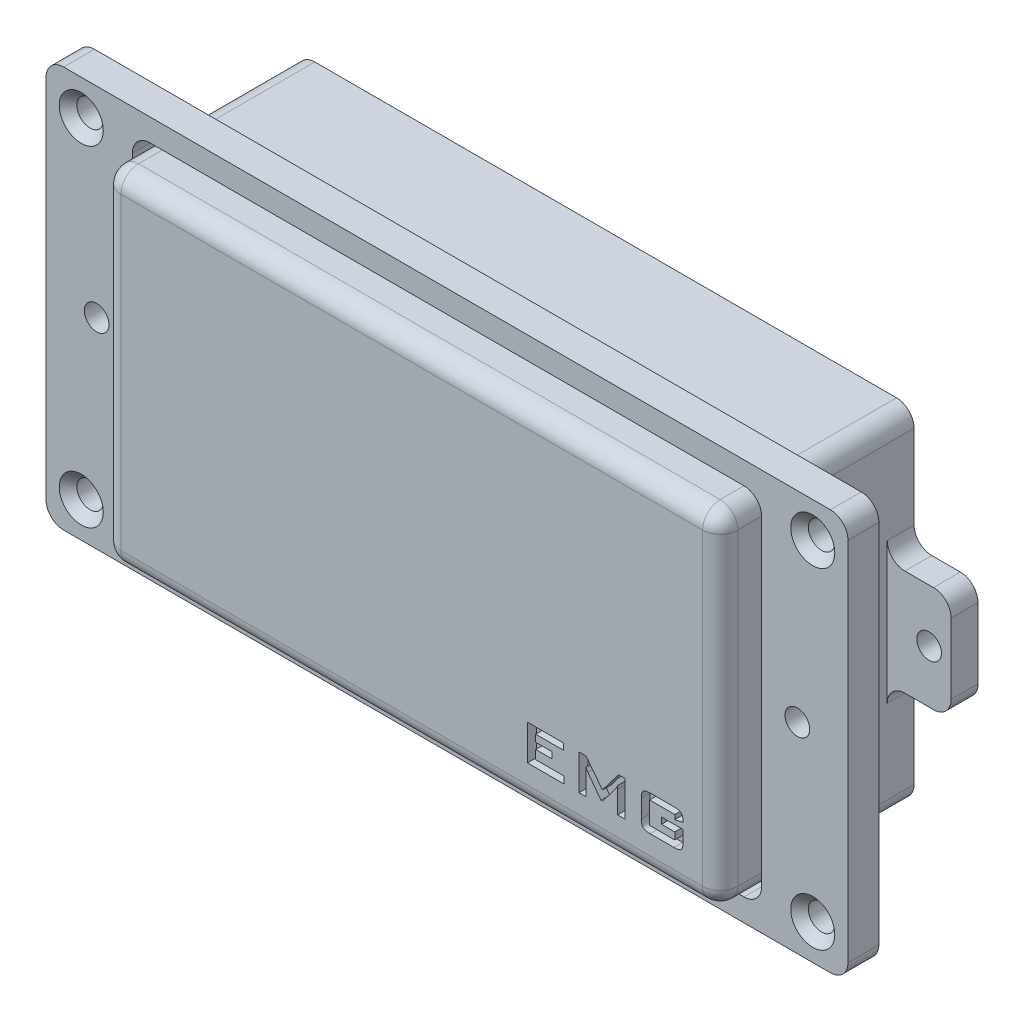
from build123d import *

# Parameters (mm, degrees)
SKETCH_1_W          = 70
SKETCH_1_H          = 39
EXTRUDE_1_DEPTH     = 22
SKETCH_2_W          = 84.5
SKETCH_2_H          = 12
SKETCH_2_R          = 1.4
EXTRUDE_2_DEPTH     = 3.05
SKETCH_3_W          = 91
SKETCH_3_H          = 45.5
SKETCH_3_W_2        = 71.4
SKETCH_3_H_2        = 40.4
EXTRUDE_3_DEPTH     = 7.5
SKETCH_4_W          = 91
SKETCH_4_H          = 45.5
SKETCH_4_W_2        = 71.4
SKETCH_4_H_2        = 40.4
CUT_EXTRUDE_1_DEPTH = 4
SKETCH_5_R          = 1.4
CUT_EXTRUDE_2_DEPTH = 64
SKETCH_6_R          = 1.5
CUT_EXTRUDE_3_DEPTH = 10
FILLET_1_R          = 2
FILLET_2_R          = 2
FILLET_3_R          = 2
CHAMFER_1_SIZE      = 1
CUT_EXTRUDE_4_DEPTH = 1
FILLET_4_R          = 2
SKETCH_8_W          = 66
SKETCH_8_H          = 35
CUT_EXTRUDE_5_DEPTH = 1
SKETCH_9_W          = 88
SKETCH_9_H          = 42.5
SKETCH_9_W_2        = 70.228427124
SKETCH_9_H_2        = 39.228427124
CUT_EXTRUDE_6_DEPTH = 1
SKETCH_11_R         = 2
SKETCH_11_R_2       = 1.5
EXTRUDE_4_DEPTH     = 1


with BuildPart() as part:
    # Sketch 1 → Extrude 1 (new body)
    with BuildSketch(Plane.XY):
        Rectangle(SKETCH_1_W, SKETCH_1_H)
    extrude(amount=-EXTRUDE_1_DEPTH)

    # Sketch 2 → Extrude 2 (add)
    with BuildSketch(Plane(origin=(0, 0, -22), x_dir=(-1, 0, 0), z_dir=(0, 0, -1))):
        Rectangle(SKETCH_2_W, SKETCH_2_H)
        with Locations((-39.75, 0)):
            Circle(SKETCH_2_R, mode=Mode.SUBTRACT)
        with Locations((39.75, 0)):
            Circle(SKETCH_2_R, mode=Mode.SUBTRACT)
    extrude(amount=-EXTRUDE_2_DEPTH)

    # Fillet 1
    fillet_1_edges = [part.edges().sort_by_distance(p)[0] for p in [
        (-35, 19.5, -11),
        (35, 19.5, -11),
        (35, -19.5, -11),
        (-35, -19.5, -11),
        (0, 19.5, 0),
        (-35, 0, 0),
        (0, -19.5, 0),
        (35, 0, 0),
    ]]
    fillet(fillet_1_edges, radius=FILLET_1_R)

    # Sketch 7 → Cut-Extrude 4 (cut)
    with BuildSketch(Plane.XY):
        with BuildLine():
            Line((29.843212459, -12.026020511), (26.986069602, -12.026020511))
            Line((26.986069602, -12.026020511), (26.986069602, -14.526020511))
            Line((26.986069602, -14.526020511), (29.843212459, -14.526020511))
            Line((29.843212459, -14.526020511), (29.843212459, -13.740306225))
            Line((29.843212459, -13.740306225), (28.343212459, -13.740306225))
            Line((28.343212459, -13.740306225), (28.343212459, -13.026020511))
            Line((28.343212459, -13.026020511), (30.771783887, -13.026020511))
            Line((30.771783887, -13.026020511), (30.771783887, -14.355261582))
            add(Edge.make_bspline(
                [(30.771783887, -14.355261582), (30.771227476, -14.399558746), (30.770155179, -14.484926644), (30.759662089, -14.607080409), (30.745100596, -14.718897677), (30.721395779, -14.818763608), (30.693021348, -14.908693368), (30.655960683, -14.986722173), (30.613764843, -15.054941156), (30.563438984, -15.112536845), (30.503071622, -15.160597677), (30.432084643, -15.201948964), (30.348647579, -15.236337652), (30.253371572, -15.263414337), (30.146428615, -15.286093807), (30.027350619, -15.301005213), (29.896172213, -15.309739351), (29.804908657, -15.311050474), (29.757274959, -15.311734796)],
                knots=[0, 0, 0, 0, 1.287740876, 2.481687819, 3.563317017, 4.56308199, 5.462791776, 6.299975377, 7.068275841, 7.7887847, 8.511887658, 9.302262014, 10.170193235, 11.128662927, 12.178892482, 13.346275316, 14.614926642, 16, 16, 16, 16], degree=3))
            Line((29.757274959, -15.311734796), (27.045221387, -15.311734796))
            add(Edge.make_bspline(
                [(27.045221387, -15.311734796), (26.998704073, -15.311048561), (26.909670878, -15.309735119), (26.781824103, -15.301050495), (26.665748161, -15.28596134), (26.561690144, -15.263637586), (26.469094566, -15.236176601), (26.387970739, -15.201699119), (26.318336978, -15.160614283), (26.259077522, -15.112494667), (26.209996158, -15.054830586), (26.168626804, -14.986921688), (26.134398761, -14.908302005), (26.106534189, -14.81877894), (26.08496672, -14.718619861), (26.06759993, -14.607280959), (26.059700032, -14.484840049), (26.058250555, -14.399538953), (26.057498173, -14.355261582)],
                knots=[0, 0, 0, 0, 1.370936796, 2.623945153, 3.774521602, 4.817517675, 5.757449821, 6.616944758, 7.408582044, 8.132975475, 8.856040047, 9.628928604, 10.468327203, 11.376846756, 12.387708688, 13.485566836, 14.694829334, 16, 16, 16, 16], degree=3))
            Line((26.057498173, -14.355261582), (26.057498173, -12.284949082))
            add(Edge.make_bspline(
                [(26.057498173, -12.284949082), (26.058222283, -12.239925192), (26.059606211, -12.153874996), (26.067792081, -12.029984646), (26.084801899, -11.917473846), (26.10677317, -11.815564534), (26.134168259, -11.72441908), (26.168653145, -11.644407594), (26.20998129, -11.575390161), (26.259029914, -11.516606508), (26.31825442, -11.467325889), (26.387891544, -11.425099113), (26.469037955, -11.389561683), (26.561491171, -11.360666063), (26.665770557, -11.338641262), (26.781869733, -11.323861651), (26.909614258, -11.313321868), (26.998694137, -11.312279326), (27.045221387, -11.311734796)],
                knots=[0, 0, 0, 0, 1.316875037, 2.516827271, 3.627751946, 4.641454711, 5.56374866, 6.406644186, 7.182863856, 7.908645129, 8.634426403, 9.425599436, 10.282837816, 11.218764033, 12.253729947, 13.395447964, 14.63961822, 16, 16, 16, 16], degree=3))
            Line((27.045221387, -11.311734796), (29.757274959, -11.311734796))
            add(Edge.make_bspline(
                [(29.757274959, -11.311734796), (29.804534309, -11.312431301), (29.895050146, -11.313765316), (30.024778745, -11.322307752), (30.142637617, -11.337730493), (30.249143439, -11.359639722), (30.343967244, -11.388566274), (30.427693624, -11.422497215), (30.498690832, -11.464351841), (30.560173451, -11.511898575), (30.610665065, -11.569375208), (30.655415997, -11.634813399), (30.690111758, -11.711985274), (30.720534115, -11.798095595), (30.743701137, -11.894988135), (30.759891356, -12.001758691), (30.770113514, -12.118829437), (30.771210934, -12.200105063), (30.771783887, -12.242538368)],
                knots=[0, 0, 0, 0, 1.397762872, 2.67713531, 3.842667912, 4.91085992, 5.888884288, 6.771660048, 7.57555246, 8.319614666, 9.059761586, 9.828787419, 10.655693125, 11.553495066, 12.527550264, 13.596648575, 14.745230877, 16, 16, 16, 16], degree=3))
            Line((30.771783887, -12.242538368), (30.771783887, -12.344100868))
            Line((30.771783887, -12.344100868), (29.843212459, -12.526020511))
            Line((29.843212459, -12.526020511), (29.843212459, -12.026020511))
        make_face()
        with BuildLine():
            Line((18.986069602, -15.311734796), (18.986069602, -11.311734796))
            Line((18.986069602, -11.311734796), (19.771783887, -11.311734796))
            Line((19.771783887, -11.311734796), (21.635623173, -13.716868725))
            Line((21.635623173, -13.716868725), (23.46151603, -11.311734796))
            Line((23.46151603, -11.311734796), (24.200355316, -11.311734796))
            Line((24.200355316, -11.311734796), (24.200355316, -15.311734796))
            Line((24.200355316, -15.311734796), (23.343212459, -15.311734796))
            Line((23.343212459, -15.311734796), (23.343212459, -12.831824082))
            add(Edge.make_bspline(
                [(23.343212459, -12.831824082), (23.343737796, -12.804657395), (23.344904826, -12.744306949), (23.352146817, -12.645307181), (23.363625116, -12.530815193), (23.37219349, -12.449380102), (23.376694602, -12.406600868)],
                knots=[0, 0, 0, 0, 0.764017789, 1.697255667, 2.790329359, 4, 4, 4, 4], degree=3))
            add(Edge.make_bspline(
                [(23.376694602, -12.406600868), (23.353664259, -12.454059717), (23.311808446, -12.540312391), (23.24923835, -12.655053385), (23.196782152, -12.748341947), (23.160865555, -12.801144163), (23.144551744, -12.825127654)],
                knots=[0, 0, 0, 0, 1.321116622, 2.401024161, 3.27372327, 4, 4, 4, 4], degree=3))
            Line((23.144551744, -12.825127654), (21.657944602, -14.811734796))
            Line((21.657944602, -14.811734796), (21.474908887, -14.811734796))
            Line((21.474908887, -14.811734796), (19.98495353, -12.817315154))
            add(Edge.make_bspline(
                [(19.98495353, -12.817315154), (19.959382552, -12.781049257), (19.910496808, -12.711717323), (19.844354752, -12.608743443), (19.792007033, -12.508791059), (19.762539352, -12.442833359), (19.748346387, -12.411065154)],
                knots=[0, 0, 0, 0, 1.130076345, 2.160442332, 3.113985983, 4, 4, 4, 4], degree=3))
            add(Edge.make_bspline(
                [(19.748346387, -12.411065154), (19.752390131, -12.450474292), (19.760087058, -12.525486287), (19.766105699, -12.633871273), (19.771438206, -12.734672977), (19.771670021, -12.799822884), (19.771783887, -12.831824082)],
                knots=[0, 0, 0, 0, 1.127408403, 2.145927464, 3.089291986, 4, 4, 4, 4], degree=3))
            Line((19.771783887, -12.831824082), (19.771783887, -15.311734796))
            Line((19.771783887, -15.311734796), (18.986069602, -15.311734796))
        make_face()
        Polygon((13.128926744, -15.311734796), (13.128926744, -11.311734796), (17.200355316, -11.311734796), (17.200355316, -12.026020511), (14.057498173, -12.026020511), (14.057498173, -12.811734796), (15.91464103, -12.811734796), (15.91464103, -13.526020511), (14.057498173, -13.526020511), (14.057498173, -14.526020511), (17.271783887, -14.526020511), (17.271783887, -15.311734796), align=None)
    extrude(amount=-CUT_EXTRUDE_4_DEPTH, mode=Mode.SUBTRACT)

    # Fillet 4
    fillet_4_edges = [part.edges().sort_by_distance(p)[0] for p in [
        (-42.25, 6, -20.475),
        (-35, 6, -20.475),
        (-42.25, -6, -20.475),
        (-35, -6, -20.475),
        (35, -6, -20.475),
        (42.25, -6, -20.475),
        (35, 6, -20.475),
        (42.25, 6, -20.475),
    ]]
    fillet(fillet_4_edges, radius=FILLET_4_R)

    # Sketch 8 → Cut-Extrude 5 (cut)
    with BuildSketch(Plane(origin=(0, 0, -22), x_dir=(-1, 0, 0), z_dir=(0, 0, -1))):
        Rectangle(SKETCH_8_W, SKETCH_8_H)
    extrude(amount=-CUT_EXTRUDE_5_DEPTH, mode=Mode.SUBTRACT)


with BuildPart() as body_2:
    # Sketch 3 → Extrude 3 (new body)
    with BuildSketch(Plane.XY):
        Rectangle(SKETCH_3_W, SKETCH_3_H)
        Rectangle(SKETCH_3_W_2, SKETCH_3_H_2, mode=Mode.SUBTRACT)
    extrude(amount=-EXTRUDE_3_DEPTH)

    # Sketch 4 → Cut-Extrude 1 (cut)
    with BuildSketch(Plane.XY):
        Rectangle(SKETCH_4_W, SKETCH_4_H)
        Rectangle(SKETCH_4_W_2, SKETCH_4_H_2, mode=Mode.SUBTRACT)
    extrude(amount=-CUT_EXTRUDE_1_DEPTH, mode=Mode.SUBTRACT)

    # Sketch 5 → Cut-Extrude 2 (cut)
    with BuildSketch(Plane(origin=(0, 0, -22), x_dir=(-1, 0, 0), z_dir=(0, 0, -1))):
        with Locations(Location((-39.75, 0, 0), (0, 0, 180))):
            Circle(SKETCH_5_R)
        with Locations(Location((39.75, 0, 0), (0, 0, 180))):
            Circle(SKETCH_5_R)
    extrude(amount=-CUT_EXTRUDE_2_DEPTH, mode=Mode.SUBTRACT)

    # Sketch 6 → Cut-Extrude 3 (cut)
    with BuildSketch(Plane.XY.offset(-4)):
        with Locations((41.5, -18.75)):
            Circle(SKETCH_6_R)
        with Locations((-41.5, -18.75)):
            Circle(SKETCH_6_R)
        with Locations((-41.5, 18.75)):
            Circle(SKETCH_6_R)
        with Locations((41.5, 18.75)):
            Circle(SKETCH_6_R)
    extrude(amount=-CUT_EXTRUDE_3_DEPTH, mode=Mode.SUBTRACT)

    # Fillet 2
    fillet_2_edges = [body_2.edges().sort_by_distance(p)[0] for p in [
        (45.5, -22.75, -5.75),
        (-45.5, -22.75, -5.75),
        (-45.5, 22.75, -5.75),
        (45.5, 22.75, -5.75),
    ]]
    fillet(fillet_2_edges, radius=FILLET_2_R)

    # Fillet 3
    fillet_3_edges = [body_2.edges().sort_by_distance(p)[0] for p in [
        (-35.7, 20.2, -5.75),
        (-35.7, -20.2, -5.75),
        (35.7, -20.2, -5.75),
        (35.7, 20.2, -5.75),
    ]]
    fillet(fillet_3_edges, radius=FILLET_3_R)

    # Chamfer 1
    chamfer_1_edges = [body_2.edges().sort_by_distance(p)[0] for p in [
        (40, 18.75, -4),
        (40, -18.75, -4),
        (-43, -18.75, -4),
        (-43, 18.75, -4),
    ]]
    chamfer(chamfer_1_edges, length=CHAMFER_1_SIZE)

    # Sketch 9 → Cut-Extrude 6 (cut)
    with BuildSketch(Plane(origin=(0, 0, -7.5), x_dir=(-1, 0, 0), z_dir=(0, 0, -1))):
        Rectangle(SKETCH_9_W, SKETCH_9_H)
        Rectangle(SKETCH_9_W_2, SKETCH_9_H_2, mode=Mode.SUBTRACT)
    extrude(amount=-CUT_EXTRUDE_6_DEPTH, mode=Mode.SUBTRACT)

    # Sketch 11 → Extrude 4 (add)
    # profile 1 of 4: a face of its own
    with BuildSketch(Plane(origin=(0, 0, -6.5), x_dir=(-1, 0, 0), z_dir=(0, 0, -1))):
        with Locations(Location((-41.5, 18.75, 0), (0, 0, 180))):
            Circle(SKETCH_11_R)
        with Locations(Location((-41.5, 18.75, 0), (0, 0, 180))):
            Circle(SKETCH_11_R_2, mode=Mode.SUBTRACT)
    # profile 2 of 4: a face of its own
    with BuildSketch(Plane(origin=(0, 0, -6.5), x_dir=(-1, 0, 0), z_dir=(0, 0, -1))):
        with Locations(Location((-41.5, -18.75, 0), (0, 0, 180))):
            Circle(SKETCH_11_R)
        with Locations(Location((-41.5, -18.75, 0), (0, 0, 180))):
            Circle(SKETCH_11_R_2, mode=Mode.SUBTRACT)
    # profile 3 of 4: a face of its own
    with BuildSketch(Plane(origin=(0, 0, -6.5), x_dir=(-1, 0, 0), z_dir=(0, 0, -1))):
        with Locations(Location((41.5, -18.75, 0), (0, 0, 180))):
            Circle(SKETCH_11_R)
        with Locations(Location((41.5, -18.75, 0), (0, 0, 180))):
            Circle(SKETCH_11_R_2, mode=Mode.SUBTRACT)
    # profile 4 of 4: a face of its own
    with BuildSketch(Plane(origin=(0, 0, -6.5), x_dir=(-1, 0, 0), z_dir=(0, 0, -1))):
        with Locations(Location((41.5, 18.75, 0), (0, 0, 180))):
            Circle(SKETCH_11_R)
        with Locations(Location((41.5, 18.75, 0), (0, 0, 180))):
            Circle(SKETCH_11_R_2, mode=Mode.SUBTRACT)
    extrude(amount=EXTRUDE_4_DEPTH)


solid = Compound([part.part, body_2.part])
